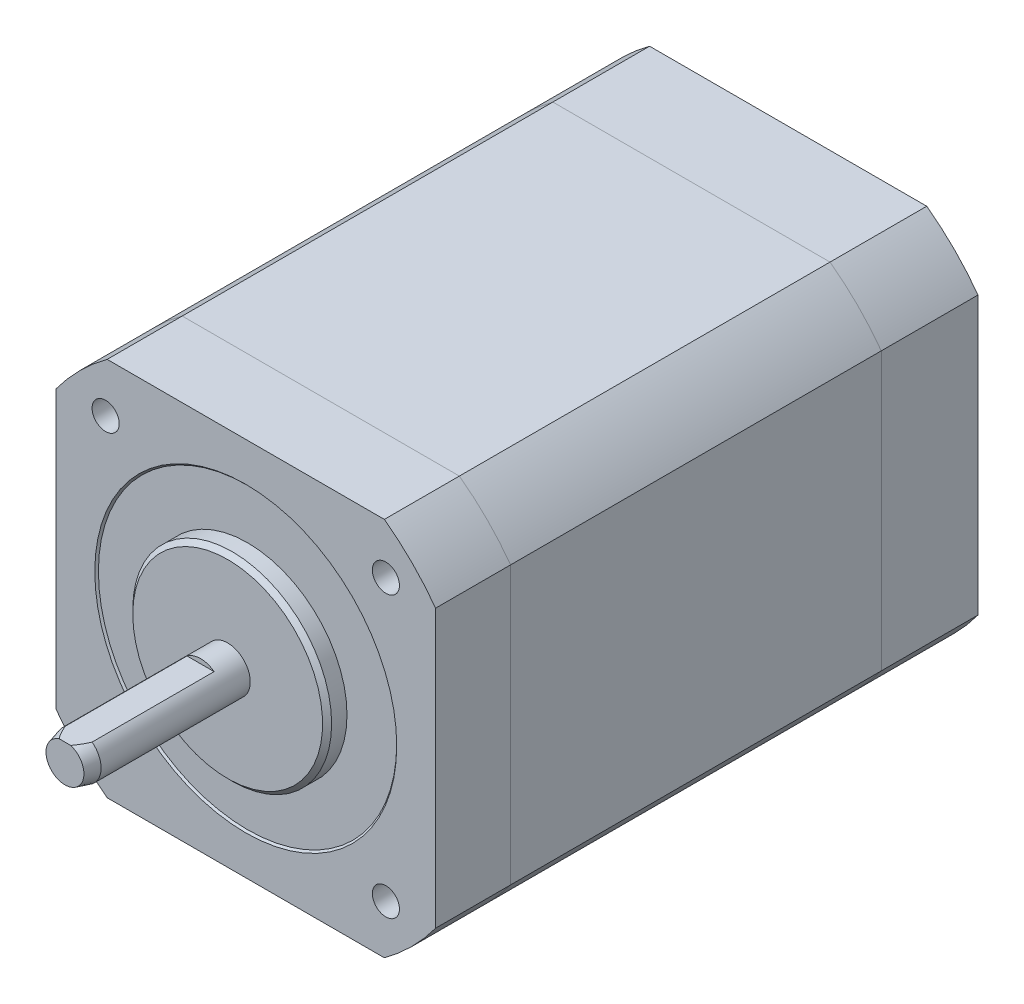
ISO-10303-21;
HEADER;
FILE_DESCRIPTION(('STEP AP214'),'2;1');
FILE_NAME('part.step','',(''),(''),'','','');
FILE_SCHEMA(('AUTOMOTIVE_DESIGN { 1 0 10303 214 1 1 1 1 }'));
ENDSEC;
DATA;
#1=APPLICATION_CONTEXT('core data for automotive mechanical design processes');
#2=APPLICATION_PROTOCOL_DEFINITION('international standard','automotive_design',2000,#1);
#3=PRODUCT_CONTEXT('',#1,'mechanical');
#4=PRODUCT('Part','Part','',(#3));
#5=PRODUCT_RELATED_PRODUCT_CATEGORY('part','',(#4));
#6=PRODUCT_DEFINITION_FORMATION('','',#4);
#7=PRODUCT_DEFINITION_CONTEXT('part definition',#1,'design');
#8=PRODUCT_DEFINITION('design','',#6,#7);
#9=PRODUCT_DEFINITION_SHAPE('','',#8);
#10=(LENGTH_UNIT() NAMED_UNIT(*) SI_UNIT(.MILLI.,.METRE.));
#11=(NAMED_UNIT(*) PLANE_ANGLE_UNIT() SI_UNIT($,.RADIAN.));
#12=(NAMED_UNIT(*) SI_UNIT($,.STERADIAN.) SOLID_ANGLE_UNIT());
#13=UNCERTAINTY_MEASURE_WITH_UNIT(LENGTH_MEASURE(1.E-05),#10,'distance_accuracy_value','');
#14=(GEOMETRIC_REPRESENTATION_CONTEXT(3) GLOBAL_UNCERTAINTY_ASSIGNED_CONTEXT((#13)) GLOBAL_UNIT_ASSIGNED_CONTEXT((#10,
#11,#12)) REPRESENTATION_CONTEXT('',''));
#15=CARTESIAN_POINT('',(0.,0.,0.));
#16=DIRECTION('',(0.,0.,1.));
#17=DIRECTION('',(1.,0.,0.));
#18=AXIS2_PLACEMENT_3D('',#15,#16,#17);
#19=CARTESIAN_POINT('',(-8.39999999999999,-25.6,-51.8));
#20=DIRECTION('',(1.,0.,0.));
#21=DIRECTION('',(0.,0.,-1.));
#22=AXIS2_PLACEMENT_3D('',#19,#20,#21);
#23=PLANE('',#22);
#24=DIRECTION('',(0.,0.,-1.));
#25=VECTOR('',#24,1.);
#26=CARTESIAN_POINT('',(-8.39999999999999,-21.,-51.8));
#27=LINE('',#26,#25);
#28=CARTESIAN_POINT('',(-8.39999999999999,-21.,-51.8));
#29=VERTEX_POINT('',#28);
#30=CARTESIAN_POINT('',(-8.39999999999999,-21.,-62.));
#31=VERTEX_POINT('',#30);
#32=EDGE_CURVE('E123',#29,#31,#27,.T.);
#33=ORIENTED_EDGE('',*,*,#32,.T.);
#34=DIRECTION('',(0.,1.,0.));
#35=VECTOR('',#34,1.);
#36=CARTESIAN_POINT('',(-8.39999999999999,-25.6,-62.));
#37=LINE('',#36,#35);
#38=CARTESIAN_POINT('',(-8.39999999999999,-25.6,-62.));
#39=VERTEX_POINT('',#38);
#40=EDGE_CURVE('E13',#39,#31,#37,.T.);
#41=ORIENTED_EDGE('',*,*,#40,.F.);
#42=DIRECTION('',(0.,0.,-1.));
#43=VECTOR('',#42,1.);
#44=CARTESIAN_POINT('',(-8.39999999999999,-25.6,-51.8));
#45=LINE('',#44,#43);
#46=CARTESIAN_POINT('',(-8.39999999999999,-25.6,-51.8));
#47=VERTEX_POINT('',#46);
#48=EDGE_CURVE('E105',#47,#39,#45,.T.);
#49=ORIENTED_EDGE('',*,*,#48,.F.);
#50=DIRECTION('',(0.,1.,0.));
#51=VECTOR('',#50,1.);
#52=CARTESIAN_POINT('',(-8.39999999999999,-25.6,-51.8));
#53=LINE('',#52,#51);
#54=EDGE_CURVE('E119',#47,#29,#53,.T.);
#55=ORIENTED_EDGE('',*,*,#54,.T.);
#56=EDGE_LOOP('',(#33,#41,#49,#55));
#57=FACE_BOUND('',#56,.T.);
#58=ADVANCED_FACE('F53',(#57),#23,.F.);
#59=CARTESIAN_POINT('',(-8.39999999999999,-25.6,-62.));
#60=DIRECTION('',(0.,0.,1.));
#61=DIRECTION('',(1.,0.,0.));
#62=AXIS2_PLACEMENT_3D('',#59,#60,#61);
#63=PLANE('',#62);
#64=DIRECTION('',(1.,0.,0.));
#65=VECTOR('',#64,1.);
#66=CARTESIAN_POINT('',(-8.39999999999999,-21.,-62.));
#67=LINE('',#66,#65);
#68=CARTESIAN_POINT('',(8.40000000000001,-21.,-62.));
#69=VERTEX_POINT('',#68);
#70=EDGE_CURVE('E110',#31,#69,#67,.T.);
#71=ORIENTED_EDGE('',*,*,#70,.T.);
#72=DIRECTION('',(0.,1.,0.));
#73=VECTOR('',#72,1.);
#74=CARTESIAN_POINT('',(8.40000000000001,-25.6,-62.));
#75=LINE('',#74,#73);
#76=CARTESIAN_POINT('',(8.40000000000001,-25.6,-62.));
#77=VERTEX_POINT('',#76);
#78=EDGE_CURVE('E62',#77,#69,#75,.T.);
#79=ORIENTED_EDGE('',*,*,#78,.F.);
#80=DIRECTION('',(1.,0.,0.));
#81=VECTOR('',#80,1.);
#82=CARTESIAN_POINT('',(-8.39999999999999,-25.6,-62.));
#83=LINE('',#82,#81);
#84=EDGE_CURVE('E100',#39,#77,#83,.T.);
#85=ORIENTED_EDGE('',*,*,#84,.F.);
#86=ORIENTED_EDGE('',*,*,#40,.T.);
#87=EDGE_LOOP('',(#71,#79,#85,#86));
#88=FACE_BOUND('',#87,.T.);
#89=ADVANCED_FACE('F109',(#88),#63,.F.);
#90=CARTESIAN_POINT('',(8.40000000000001,-25.6,-51.8));
#91=DIRECTION('',(-1.,0.,0.));
#92=DIRECTION('',(0.,-1.,0.));
#93=AXIS2_PLACEMENT_3D('',#90,#91,#92);
#94=PLANE('',#93);
#95=DIRECTION('',(0.,0.,1.));
#96=VECTOR('',#95,1.);
#97=CARTESIAN_POINT('',(8.40000000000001,-21.,-51.8));
#98=LINE('',#97,#96);
#99=CARTESIAN_POINT('',(8.40000000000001,-21.,-51.8));
#100=VERTEX_POINT('',#99);
#101=EDGE_CURVE('E87',#69,#100,#98,.T.);
#102=ORIENTED_EDGE('',*,*,#101,.T.);
#103=DIRECTION('',(0.,1.,0.));
#104=VECTOR('',#103,1.);
#105=CARTESIAN_POINT('',(8.40000000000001,-25.6,-51.8));
#106=LINE('',#105,#104);
#107=CARTESIAN_POINT('',(8.40000000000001,-25.6,-51.8));
#108=VERTEX_POINT('',#107);
#109=EDGE_CURVE('E112',#108,#100,#106,.T.);
#110=ORIENTED_EDGE('',*,*,#109,.F.);
#111=DIRECTION('',(0.,0.,1.));
#112=VECTOR('',#111,1.);
#113=CARTESIAN_POINT('',(8.40000000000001,-25.6,-51.8));
#114=LINE('',#113,#112);
#115=EDGE_CURVE('E103',#77,#108,#114,.T.);
#116=ORIENTED_EDGE('',*,*,#115,.F.);
#117=ORIENTED_EDGE('',*,*,#78,.T.);
#118=EDGE_LOOP('',(#102,#110,#116,#117));
#119=FACE_BOUND('',#118,.T.);
#120=ADVANCED_FACE('F113',(#119),#94,.F.);
#121=CARTESIAN_POINT('',(-8.39999999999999,-25.6,-51.8));
#122=DIRECTION('',(0.,0.,-1.));
#123=DIRECTION('',(-1.,0.,0.));
#124=AXIS2_PLACEMENT_3D('',#121,#122,#123);
#125=PLANE('',#124);
#126=DIRECTION('',(-1.,0.,0.));
#127=VECTOR('',#126,1.);
#128=CARTESIAN_POINT('',(-8.39999999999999,-21.,-51.8));
#129=LINE('',#128,#127);
#130=EDGE_CURVE('E93',#100,#29,#129,.T.);
#131=ORIENTED_EDGE('',*,*,#130,.T.);
#132=ORIENTED_EDGE('',*,*,#54,.F.);
#133=DIRECTION('',(-1.,0.,0.));
#134=VECTOR('',#133,1.);
#135=CARTESIAN_POINT('',(-8.39999999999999,-25.6,-51.8));
#136=LINE('',#135,#134);
#137=EDGE_CURVE('E70',#108,#47,#136,.T.);
#138=ORIENTED_EDGE('',*,*,#137,.F.);
#139=ORIENTED_EDGE('',*,*,#109,.T.);
#140=EDGE_LOOP('',(#131,#132,#138,#139));
#141=FACE_BOUND('',#140,.T.);
#142=ADVANCED_FACE('F135',(#141),#125,.F.);
#143=CARTESIAN_POINT('',(0.,-25.6,0.));
#144=DIRECTION('',(0.,-1.,0.));
#145=DIRECTION('',(0.,0.,-1.));
#146=AXIS2_PLACEMENT_3D('',#143,#144,#145);
#147=PLANE('',#146);
#148=ORIENTED_EDGE('',*,*,#48,.T.);
#149=ORIENTED_EDGE('',*,*,#84,.T.);
#150=ORIENTED_EDGE('',*,*,#115,.T.);
#151=ORIENTED_EDGE('',*,*,#137,.T.);
#152=EDGE_LOOP('',(#148,#149,#150,#151));
#153=FACE_BOUND('',#152,.T.);
#154=ADVANCED_FACE('F101',(#153),#147,.T.);
#155=CARTESIAN_POINT('',(0.,-21.,0.));
#156=DIRECTION('',(0.,-1.,0.));
#157=DIRECTION('',(0.,0.,-1.));
#158=AXIS2_PLACEMENT_3D('',#155,#156,#157);
#159=PLANE('',#158);
#160=ORIENTED_EDGE('',*,*,#32,.F.);
#161=ORIENTED_EDGE('',*,*,#130,.F.);
#162=ORIENTED_EDGE('',*,*,#101,.F.);
#163=ORIENTED_EDGE('',*,*,#70,.F.);
#164=EDGE_LOOP('',(#160,#161,#162,#163));
#165=FACE_BOUND('',#164,.T.);
#166=ADVANCED_FACE('F138',(#165),#159,.F.);
#167=CLOSED_SHELL('',(#58,#89,#120,#142,#154,#166));
#168=MANIFOLD_SOLID_BREP('B2',#167);
#169=CARTESIAN_POINT('',(0.,0.,-62.));
#170=DIRECTION('',(0.,0.,1.));
#171=DIRECTION('',(1.,0.,0.));
#172=AXIS2_PLACEMENT_3D('',#169,#170,#171);
#173=CYLINDRICAL_SURFACE('',#172,26.);
#174=CARTESIAN_POINT('',(0.,0.,-51.3));
#175=DIRECTION('',(0.,0.,-1.));
#176=DIRECTION('',(-1.,0.,0.));
#177=AXIS2_PLACEMENT_3D('',#174,#175,#176);
#178=CIRCLE('',#177,26.);
#179=CARTESIAN_POINT('',(21.,-15.3297097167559,-51.3));
#180=VERTEX_POINT('',#179);
#181=CARTESIAN_POINT('',(15.3297097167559,-21.,-51.3));
#182=VERTEX_POINT('',#181);
#183=EDGE_CURVE('E308',#180,#182,#178,.T.);
#184=ORIENTED_EDGE('',*,*,#183,.T.);
#185=DIRECTION('',(0.,0.,1.));
#186=VECTOR('',#185,1.);
#187=CARTESIAN_POINT('',(15.3297097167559,-21.,-62.));
#188=LINE('',#187,#186);
#189=CARTESIAN_POINT('',(15.3297097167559,-21.,-62.));
#190=VERTEX_POINT('',#189);
#191=EDGE_CURVE('E51',#190,#182,#188,.T.);
#192=ORIENTED_EDGE('',*,*,#191,.F.);
#193=CARTESIAN_POINT('',(0.,0.,-62.));
#194=DIRECTION('',(0.,0.,-1.));
#195=DIRECTION('',(-1.,0.,0.));
#196=AXIS2_PLACEMENT_3D('',#193,#194,#195);
#197=CIRCLE('',#196,26.);
#198=CARTESIAN_POINT('',(21.,-15.3297097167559,-62.));
#199=VERTEX_POINT('',#198);
#200=EDGE_CURVE('E329',#199,#190,#197,.T.);
#201=ORIENTED_EDGE('',*,*,#200,.F.);
#202=DIRECTION('',(0.,0.,1.));
#203=VECTOR('',#202,1.);
#204=CARTESIAN_POINT('',(21.,-15.3297097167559,-62.));
#205=LINE('',#204,#203);
#206=EDGE_CURVE('E304',#199,#180,#205,.T.);
#207=ORIENTED_EDGE('',*,*,#206,.T.);
#208=EDGE_LOOP('',(#184,#192,#201,#207));
#209=FACE_BOUND('',#208,.T.);
#210=ADVANCED_FACE('F205',(#209),#173,.T.);
#211=CARTESIAN_POINT('',(15.3297097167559,-21.,-62.));
#212=DIRECTION('',(0.,1.,0.));
#213=DIRECTION('',(-1.,0.,0.));
#214=AXIS2_PLACEMENT_3D('',#211,#212,#213);
#215=PLANE('',#214);
#216=DIRECTION('',(-1.,0.,0.));
#217=VECTOR('',#216,1.);
#218=CARTESIAN_POINT('',(15.3297097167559,-21.,-51.3));
#219=LINE('',#218,#217);
#220=CARTESIAN_POINT('',(-15.3297097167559,-21.,-51.3));
#221=VERTEX_POINT('',#220);
#222=EDGE_CURVE('E312',#182,#221,#219,.T.);
#223=ORIENTED_EDGE('',*,*,#222,.T.);
#224=DIRECTION('',(0.,0.,1.));
#225=VECTOR('',#224,1.);
#226=CARTESIAN_POINT('',(-15.3297097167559,-21.,-62.));
#227=LINE('',#226,#225);
#228=CARTESIAN_POINT('',(-15.3297097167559,-21.,-62.));
#229=VERTEX_POINT('',#228);
#230=EDGE_CURVE('E214',#229,#221,#227,.T.);
#231=ORIENTED_EDGE('',*,*,#230,.F.);
#232=DIRECTION('',(-1.,0.,0.));
#233=VECTOR('',#232,1.);
#234=CARTESIAN_POINT('',(15.3297097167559,-21.,-62.));
#235=LINE('',#234,#233);
#236=EDGE_CURVE('E265',#190,#229,#235,.T.);
#237=ORIENTED_EDGE('',*,*,#236,.F.);
#238=ORIENTED_EDGE('',*,*,#191,.T.);
#239=EDGE_LOOP('',(#223,#231,#237,#238));
#240=FACE_BOUND('',#239,.T.);
#241=ADVANCED_FACE('F374',(#240),#215,.F.);
#242=CARTESIAN_POINT('',(0.,0.,-62.));
#243=DIRECTION('',(0.,0.,1.));
#244=DIRECTION('',(1.,0.,0.));
#245=AXIS2_PLACEMENT_3D('',#242,#243,#244);
#246=CYLINDRICAL_SURFACE('',#245,26.);
#247=CARTESIAN_POINT('',(0.,0.,-51.3));
#248=DIRECTION('',(0.,0.,-1.));
#249=DIRECTION('',(-1.,0.,0.));
#250=AXIS2_PLACEMENT_3D('',#247,#248,#249);
#251=CIRCLE('',#250,26.);
#252=CARTESIAN_POINT('',(-21.,-15.3297097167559,-51.3));
#253=VERTEX_POINT('',#252);
#254=EDGE_CURVE('E315',#221,#253,#251,.T.);
#255=ORIENTED_EDGE('',*,*,#254,.T.);
#256=DIRECTION('',(0.,0.,1.));
#257=VECTOR('',#256,1.);
#258=CARTESIAN_POINT('',(-21.,-15.3297097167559,-62.));
#259=LINE('',#258,#257);
#260=CARTESIAN_POINT('',(-21.,-15.3297097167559,-62.));
#261=VERTEX_POINT('',#260);
#262=EDGE_CURVE('E340',#261,#253,#259,.T.);
#263=ORIENTED_EDGE('',*,*,#262,.F.);
#264=CARTESIAN_POINT('',(0.,0.,-62.));
#265=DIRECTION('',(0.,0.,-1.));
#266=DIRECTION('',(-1.,0.,0.));
#267=AXIS2_PLACEMENT_3D('',#264,#265,#266);
#268=CIRCLE('',#267,26.);
#269=EDGE_CURVE('E350',#229,#261,#268,.T.);
#270=ORIENTED_EDGE('',*,*,#269,.F.);
#271=ORIENTED_EDGE('',*,*,#230,.T.);
#272=EDGE_LOOP('',(#255,#263,#270,#271));
#273=FACE_BOUND('',#272,.T.);
#274=ADVANCED_FACE('F348',(#273),#246,.T.);
#275=CARTESIAN_POINT('',(-21.,-15.3297097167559,-62.));
#276=DIRECTION('',(1.,0.,0.));
#277=DIRECTION('',(0.,1.,0.));
#278=AXIS2_PLACEMENT_3D('',#275,#276,#277);
#279=PLANE('',#278);
#280=DIRECTION('',(0.,1.,0.));
#281=VECTOR('',#280,1.);
#282=CARTESIAN_POINT('',(-21.,-15.3297097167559,-51.3));
#283=LINE('',#282,#281);
#284=CARTESIAN_POINT('',(-21.,15.3297097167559,-51.3));
#285=VERTEX_POINT('',#284);
#286=EDGE_CURVE('E318',#253,#285,#283,.T.);
#287=ORIENTED_EDGE('',*,*,#286,.T.);
#288=DIRECTION('',(0.,0.,1.));
#289=VECTOR('',#288,1.);
#290=CARTESIAN_POINT('',(-21.,15.3297097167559,-62.));
#291=LINE('',#290,#289);
#292=CARTESIAN_POINT('',(-21.,15.3297097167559,-62.));
#293=VERTEX_POINT('',#292);
#294=EDGE_CURVE('E336',#293,#285,#291,.T.);
#295=ORIENTED_EDGE('',*,*,#294,.F.);
#296=DIRECTION('',(0.,1.,0.));
#297=VECTOR('',#296,1.);
#298=CARTESIAN_POINT('',(-21.,-15.3297097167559,-62.));
#299=LINE('',#298,#297);
#300=EDGE_CURVE('E362',#261,#293,#299,.T.);
#301=ORIENTED_EDGE('',*,*,#300,.F.);
#302=ORIENTED_EDGE('',*,*,#262,.T.);
#303=EDGE_LOOP('',(#287,#295,#301,#302));
#304=FACE_BOUND('',#303,.T.);
#305=ADVANCED_FACE('F358',(#304),#279,.F.);
#306=CARTESIAN_POINT('',(0.,0.,-62.));
#307=DIRECTION('',(0.,0.,1.));
#308=DIRECTION('',(1.,0.,0.));
#309=AXIS2_PLACEMENT_3D('',#306,#307,#308);
#310=CYLINDRICAL_SURFACE('',#309,26.);
#311=CARTESIAN_POINT('',(0.,0.,-51.3));
#312=DIRECTION('',(0.,0.,-1.));
#313=DIRECTION('',(-1.,0.,0.));
#314=AXIS2_PLACEMENT_3D('',#311,#312,#313);
#315=CIRCLE('',#314,26.);
#316=CARTESIAN_POINT('',(-15.3297097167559,21.,-51.3));
#317=VERTEX_POINT('',#316);
#318=EDGE_CURVE('E321',#285,#317,#315,.T.);
#319=ORIENTED_EDGE('',*,*,#318,.T.);
#320=DIRECTION('',(0.,0.,1.));
#321=VECTOR('',#320,1.);
#322=CARTESIAN_POINT('',(-15.3297097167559,21.,-62.));
#323=LINE('',#322,#321);
#324=CARTESIAN_POINT('',(-15.3297097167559,21.,-62.));
#325=VERTEX_POINT('',#324);
#326=EDGE_CURVE('E295',#325,#317,#323,.T.);
#327=ORIENTED_EDGE('',*,*,#326,.F.);
#328=CARTESIAN_POINT('',(0.,0.,-62.));
#329=DIRECTION('',(0.,0.,-1.));
#330=DIRECTION('',(-1.,0.,0.));
#331=AXIS2_PLACEMENT_3D('',#328,#329,#330);
#332=CIRCLE('',#331,26.);
#333=EDGE_CURVE('E284',#293,#325,#332,.T.);
#334=ORIENTED_EDGE('',*,*,#333,.F.);
#335=ORIENTED_EDGE('',*,*,#294,.T.);
#336=EDGE_LOOP('',(#319,#327,#334,#335));
#337=FACE_BOUND('',#336,.T.);
#338=ADVANCED_FACE('F361',(#337),#310,.T.);
#339=CARTESIAN_POINT('',(-15.3297097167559,21.,-62.));
#340=DIRECTION('',(0.,-1.,0.));
#341=DIRECTION('',(0.,0.,-1.));
#342=AXIS2_PLACEMENT_3D('',#339,#340,#341);
#343=PLANE('',#342);
#344=DIRECTION('',(1.,0.,0.));
#345=VECTOR('',#344,1.);
#346=CARTESIAN_POINT('',(-15.3297097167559,21.,-51.3));
#347=LINE('',#346,#345);
#348=CARTESIAN_POINT('',(15.3297097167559,21.,-51.3));
#349=VERTEX_POINT('',#348);
#350=EDGE_CURVE('E293',#317,#349,#347,.T.);
#351=ORIENTED_EDGE('',*,*,#350,.T.);
#352=DIRECTION('',(0.,0.,1.));
#353=VECTOR('',#352,1.);
#354=CARTESIAN_POINT('',(15.3297097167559,21.,-62.));
#355=LINE('',#354,#353);
#356=CARTESIAN_POINT('',(15.3297097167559,21.,-62.));
#357=VERTEX_POINT('',#356);
#358=EDGE_CURVE('E290',#357,#349,#355,.T.);
#359=ORIENTED_EDGE('',*,*,#358,.F.);
#360=DIRECTION('',(1.,0.,0.));
#361=VECTOR('',#360,1.);
#362=CARTESIAN_POINT('',(-15.3297097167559,21.,-62.));
#363=LINE('',#362,#361);
#364=EDGE_CURVE('E278',#325,#357,#363,.T.);
#365=ORIENTED_EDGE('',*,*,#364,.F.);
#366=ORIENTED_EDGE('',*,*,#326,.T.);
#367=EDGE_LOOP('',(#351,#359,#365,#366));
#368=FACE_BOUND('',#367,.T.);
#369=ADVANCED_FACE('F291',(#368),#343,.F.);
#370=CARTESIAN_POINT('',(0.,0.,-62.));
#371=DIRECTION('',(0.,0.,1.));
#372=DIRECTION('',(1.,0.,0.));
#373=AXIS2_PLACEMENT_3D('',#370,#371,#372);
#374=CYLINDRICAL_SURFACE('',#373,26.);
#375=CARTESIAN_POINT('',(0.,0.,-51.3));
#376=DIRECTION('',(0.,0.,-1.));
#377=DIRECTION('',(-1.,0.,0.));
#378=AXIS2_PLACEMENT_3D('',#375,#376,#377);
#379=CIRCLE('',#378,26.);
#380=CARTESIAN_POINT('',(21.,15.3297097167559,-51.3));
#381=VERTEX_POINT('',#380);
#382=EDGE_CURVE('E251',#349,#381,#379,.T.);
#383=ORIENTED_EDGE('',*,*,#382,.T.);
#384=DIRECTION('',(0.,0.,1.));
#385=VECTOR('',#384,1.);
#386=CARTESIAN_POINT('',(21.,15.3297097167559,-62.));
#387=LINE('',#386,#385);
#388=CARTESIAN_POINT('',(21.,15.3297097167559,-62.));
#389=VERTEX_POINT('',#388);
#390=EDGE_CURVE('E296',#389,#381,#387,.T.);
#391=ORIENTED_EDGE('',*,*,#390,.F.);
#392=CARTESIAN_POINT('',(0.,0.,-62.));
#393=DIRECTION('',(0.,0.,-1.));
#394=DIRECTION('',(-1.,0.,0.));
#395=AXIS2_PLACEMENT_3D('',#392,#393,#394);
#396=CIRCLE('',#395,26.);
#397=EDGE_CURVE('E282',#357,#389,#396,.T.);
#398=ORIENTED_EDGE('',*,*,#397,.F.);
#399=ORIENTED_EDGE('',*,*,#358,.T.);
#400=EDGE_LOOP('',(#383,#391,#398,#399));
#401=FACE_BOUND('',#400,.T.);
#402=ADVANCED_FACE('F298',(#401),#374,.T.);
#403=CARTESIAN_POINT('',(21.,15.3297097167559,-62.));
#404=DIRECTION('',(-1.,0.,0.));
#405=DIRECTION('',(0.,-1.,0.));
#406=AXIS2_PLACEMENT_3D('',#403,#404,#405);
#407=PLANE('',#406);
#408=DIRECTION('',(0.,-1.,0.));
#409=VECTOR('',#408,1.);
#410=CARTESIAN_POINT('',(21.,15.3297097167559,-51.3));
#411=LINE('',#410,#409);
#412=EDGE_CURVE('E257',#381,#180,#411,.T.);
#413=ORIENTED_EDGE('',*,*,#412,.T.);
#414=ORIENTED_EDGE('',*,*,#206,.F.);
#415=DIRECTION('',(0.,-1.,0.));
#416=VECTOR('',#415,1.);
#417=CARTESIAN_POINT('',(21.,15.3297097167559,-62.));
#418=LINE('',#417,#416);
#419=EDGE_CURVE('E222',#389,#199,#418,.T.);
#420=ORIENTED_EDGE('',*,*,#419,.F.);
#421=ORIENTED_EDGE('',*,*,#390,.T.);
#422=EDGE_LOOP('',(#413,#414,#420,#421));
#423=FACE_BOUND('',#422,.T.);
#424=ADVANCED_FACE('F390',(#423),#407,.F.);
#425=CARTESIAN_POINT('',(0.,0.,-62.));
#426=DIRECTION('',(0.,0.,-1.));
#427=DIRECTION('',(-1.,0.,0.));
#428=AXIS2_PLACEMENT_3D('',#425,#426,#427);
#429=PLANE('',#428);
#430=ORIENTED_EDGE('',*,*,#200,.T.);
#431=ORIENTED_EDGE('',*,*,#236,.T.);
#432=ORIENTED_EDGE('',*,*,#269,.T.);
#433=ORIENTED_EDGE('',*,*,#300,.T.);
#434=ORIENTED_EDGE('',*,*,#333,.T.);
#435=ORIENTED_EDGE('',*,*,#364,.T.);
#436=ORIENTED_EDGE('',*,*,#397,.T.);
#437=ORIENTED_EDGE('',*,*,#419,.T.);
#438=EDGE_LOOP('',(#430,#431,#432,#433,#434,#435,#436,#437));
#439=FACE_BOUND('',#438,.T.);
#440=ADVANCED_FACE('F280',(#439),#429,.T.);
#441=CARTESIAN_POINT('',(0.,0.,-51.3));
#442=DIRECTION('',(0.,0.,-1.));
#443=DIRECTION('',(-1.,0.,0.));
#444=AXIS2_PLACEMENT_3D('',#441,#442,#443);
#445=PLANE('',#444);
#446=ORIENTED_EDGE('',*,*,#183,.F.);
#447=ORIENTED_EDGE('',*,*,#412,.F.);
#448=ORIENTED_EDGE('',*,*,#382,.F.);
#449=ORIENTED_EDGE('',*,*,#350,.F.);
#450=ORIENTED_EDGE('',*,*,#318,.F.);
#451=ORIENTED_EDGE('',*,*,#286,.F.);
#452=ORIENTED_EDGE('',*,*,#254,.F.);
#453=ORIENTED_EDGE('',*,*,#222,.F.);
#454=EDGE_LOOP('',(#446,#447,#448,#449,#450,#451,#452,#453));
#455=FACE_BOUND('',#454,.T.);
#456=ADVANCED_FACE('F354',(#455),#445,.F.);
#457=CLOSED_SHELL('',(#210,#241,#274,#305,#338,#369,#402,#424,#440,#456));
#458=MANIFOLD_SOLID_BREP('B7',#457);
#459=CARTESIAN_POINT('',(0.,0.,-51.3));
#460=DIRECTION('',(0.,0.,1.));
#461=DIRECTION('',(1.,0.,0.));
#462=AXIS2_PLACEMENT_3D('',#459,#460,#461);
#463=CYLINDRICAL_SURFACE('',#462,26.);
#464=CARTESIAN_POINT('',(0.,0.,-10.3));
#465=DIRECTION('',(0.,0.,-1.));
#466=DIRECTION('',(-1.,0.,0.));
#467=AXIS2_PLACEMENT_3D('',#464,#465,#466);
#468=CIRCLE('',#467,26.);
#469=CARTESIAN_POINT('',(21.,-15.3297097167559,-10.3));
#470=VERTEX_POINT('',#469);
#471=CARTESIAN_POINT('',(15.3297097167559,-21.,-10.3));
#472=VERTEX_POINT('',#471);
#473=EDGE_CURVE('E579',#470,#472,#468,.T.);
#474=ORIENTED_EDGE('',*,*,#473,.T.);
#475=DIRECTION('',(0.,0.,1.));
#476=VECTOR('',#475,1.);
#477=CARTESIAN_POINT('',(15.3297097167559,-21.,-51.3));
#478=LINE('',#477,#476);
#479=CARTESIAN_POINT('',(15.3297097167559,-21.,-51.3));
#480=VERTEX_POINT('',#479);
#481=EDGE_CURVE('E203',#480,#472,#478,.T.);
#482=ORIENTED_EDGE('',*,*,#481,.F.);
#483=CARTESIAN_POINT('',(0.,0.,-51.3));
#484=DIRECTION('',(0.,0.,-1.));
#485=DIRECTION('',(-1.,0.,0.));
#486=AXIS2_PLACEMENT_3D('',#483,#484,#485);
#487=CIRCLE('',#486,26.);
#488=CARTESIAN_POINT('',(21.,-15.3297097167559,-51.3));
#489=VERTEX_POINT('',#488);
#490=EDGE_CURVE('E599',#489,#480,#487,.T.);
#491=ORIENTED_EDGE('',*,*,#490,.F.);
#492=DIRECTION('',(0.,0.,1.));
#493=VECTOR('',#492,1.);
#494=CARTESIAN_POINT('',(21.,-15.3297097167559,-51.3));
#495=LINE('',#494,#493);
#496=EDGE_CURVE('E575',#489,#470,#495,.T.);
#497=ORIENTED_EDGE('',*,*,#496,.T.);
#498=EDGE_LOOP('',(#474,#482,#491,#497));
#499=FACE_BOUND('',#498,.T.);
#500=ADVANCED_FACE('F476',(#499),#463,.T.);
#501=CARTESIAN_POINT('',(15.3297097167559,-21.,-51.3));
#502=DIRECTION('',(0.,1.,0.));
#503=DIRECTION('',(0.,0.,1.));
#504=AXIS2_PLACEMENT_3D('',#501,#502,#503);
#505=PLANE('',#504);
#506=DIRECTION('',(-1.,0.,0.));
#507=VECTOR('',#506,1.);
#508=CARTESIAN_POINT('',(15.3297097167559,-21.,-10.3));
#509=LINE('',#508,#507);
#510=CARTESIAN_POINT('',(-15.3297097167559,-21.,-10.3));
#511=VERTEX_POINT('',#510);
#512=EDGE_CURVE('E583',#472,#511,#509,.T.);
#513=ORIENTED_EDGE('',*,*,#512,.T.);
#514=DIRECTION('',(0.,0.,1.));
#515=VECTOR('',#514,1.);
#516=CARTESIAN_POINT('',(-15.3297097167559,-21.,-51.3));
#517=LINE('',#516,#515);
#518=CARTESIAN_POINT('',(-15.3297097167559,-21.,-51.3));
#519=VERTEX_POINT('',#518);
#520=EDGE_CURVE('E485',#519,#511,#517,.T.);
#521=ORIENTED_EDGE('',*,*,#520,.F.);
#522=DIRECTION('',(-1.,0.,0.));
#523=VECTOR('',#522,1.);
#524=CARTESIAN_POINT('',(15.3297097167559,-21.,-51.3));
#525=LINE('',#524,#523);
#526=EDGE_CURVE('E536',#480,#519,#525,.T.);
#527=ORIENTED_EDGE('',*,*,#526,.F.);
#528=ORIENTED_EDGE('',*,*,#481,.T.);
#529=EDGE_LOOP('',(#513,#521,#527,#528));
#530=FACE_BOUND('',#529,.T.);
#531=ADVANCED_FACE('F645',(#530),#505,.F.);
#532=CARTESIAN_POINT('',(0.,0.,-51.3));
#533=DIRECTION('',(0.,0.,1.));
#534=DIRECTION('',(1.,0.,0.));
#535=AXIS2_PLACEMENT_3D('',#532,#533,#534);
#536=CYLINDRICAL_SURFACE('',#535,26.);
#537=CARTESIAN_POINT('',(0.,0.,-10.3));
#538=DIRECTION('',(0.,0.,-1.));
#539=DIRECTION('',(-1.,0.,0.));
#540=AXIS2_PLACEMENT_3D('',#537,#538,#539);
#541=CIRCLE('',#540,26.);
#542=CARTESIAN_POINT('',(-21.,-15.3297097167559,-10.3));
#543=VERTEX_POINT('',#542);
#544=EDGE_CURVE('E586',#511,#543,#541,.T.);
#545=ORIENTED_EDGE('',*,*,#544,.T.);
#546=DIRECTION('',(0.,0.,1.));
#547=VECTOR('',#546,1.);
#548=CARTESIAN_POINT('',(-21.,-15.3297097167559,-51.3));
#549=LINE('',#548,#547);
#550=CARTESIAN_POINT('',(-21.,-15.3297097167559,-51.3));
#551=VERTEX_POINT('',#550);
#552=EDGE_CURVE('E610',#551,#543,#549,.T.);
#553=ORIENTED_EDGE('',*,*,#552,.F.);
#554=CARTESIAN_POINT('',(0.,0.,-51.3));
#555=DIRECTION('',(0.,0.,-1.));
#556=DIRECTION('',(-1.,0.,0.));
#557=AXIS2_PLACEMENT_3D('',#554,#555,#556);
#558=CIRCLE('',#557,26.);
#559=EDGE_CURVE('E621',#519,#551,#558,.T.);
#560=ORIENTED_EDGE('',*,*,#559,.F.);
#561=ORIENTED_EDGE('',*,*,#520,.T.);
#562=EDGE_LOOP('',(#545,#553,#560,#561));
#563=FACE_BOUND('',#562,.T.);
#564=ADVANCED_FACE('F619',(#563),#536,.T.);
#565=CARTESIAN_POINT('',(-21.,-15.3297097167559,-51.3));
#566=DIRECTION('',(1.,0.,0.));
#567=DIRECTION('',(0.,0.,-1.));
#568=AXIS2_PLACEMENT_3D('',#565,#566,#567);
#569=PLANE('',#568);
#570=DIRECTION('',(0.,1.,0.));
#571=VECTOR('',#570,1.);
#572=CARTESIAN_POINT('',(-21.,-15.3297097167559,-10.3));
#573=LINE('',#572,#571);
#574=CARTESIAN_POINT('',(-21.,15.3297097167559,-10.3));
#575=VERTEX_POINT('',#574);
#576=EDGE_CURVE('E589',#543,#575,#573,.T.);
#577=ORIENTED_EDGE('',*,*,#576,.T.);
#578=DIRECTION('',(0.,0.,1.));
#579=VECTOR('',#578,1.);
#580=CARTESIAN_POINT('',(-21.,15.3297097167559,-51.3));
#581=LINE('',#580,#579);
#582=CARTESIAN_POINT('',(-21.,15.3297097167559,-51.3));
#583=VERTEX_POINT('',#582);
#584=EDGE_CURVE('E606',#583,#575,#581,.T.);
#585=ORIENTED_EDGE('',*,*,#584,.F.);
#586=DIRECTION('',(0.,1.,0.));
#587=VECTOR('',#586,1.);
#588=CARTESIAN_POINT('',(-21.,-15.3297097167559,-51.3));
#589=LINE('',#588,#587);
#590=EDGE_CURVE('E634',#551,#583,#589,.T.);
#591=ORIENTED_EDGE('',*,*,#590,.F.);
#592=ORIENTED_EDGE('',*,*,#552,.T.);
#593=EDGE_LOOP('',(#577,#585,#591,#592));
#594=FACE_BOUND('',#593,.T.);
#595=ADVANCED_FACE('F629',(#594),#569,.F.);
#596=CARTESIAN_POINT('',(0.,0.,-51.3));
#597=DIRECTION('',(0.,0.,1.));
#598=DIRECTION('',(1.,0.,0.));
#599=AXIS2_PLACEMENT_3D('',#596,#597,#598);
#600=CYLINDRICAL_SURFACE('',#599,26.);
#601=CARTESIAN_POINT('',(0.,0.,-10.3));
#602=DIRECTION('',(0.,0.,-1.));
#603=DIRECTION('',(-1.,0.,0.));
#604=AXIS2_PLACEMENT_3D('',#601,#602,#603);
#605=CIRCLE('',#604,26.);
#606=CARTESIAN_POINT('',(-15.3297097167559,21.,-10.3));
#607=VERTEX_POINT('',#606);
#608=EDGE_CURVE('E591',#575,#607,#605,.T.);
#609=ORIENTED_EDGE('',*,*,#608,.T.);
#610=DIRECTION('',(0.,0.,1.));
#611=VECTOR('',#610,1.);
#612=CARTESIAN_POINT('',(-15.3297097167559,21.,-51.3));
#613=LINE('',#612,#611);
#614=CARTESIAN_POINT('',(-15.3297097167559,21.,-51.3));
#615=VERTEX_POINT('',#614);
#616=EDGE_CURVE('E566',#615,#607,#613,.T.);
#617=ORIENTED_EDGE('',*,*,#616,.F.);
#618=CARTESIAN_POINT('',(0.,0.,-51.3));
#619=DIRECTION('',(0.,0.,-1.));
#620=DIRECTION('',(-1.,0.,0.));
#621=AXIS2_PLACEMENT_3D('',#618,#619,#620);
#622=CIRCLE('',#621,26.);
#623=EDGE_CURVE('E555',#583,#615,#622,.T.);
#624=ORIENTED_EDGE('',*,*,#623,.F.);
#625=ORIENTED_EDGE('',*,*,#584,.T.);
#626=EDGE_LOOP('',(#609,#617,#624,#625));
#627=FACE_BOUND('',#626,.T.);
#628=ADVANCED_FACE('F632',(#627),#600,.T.);
#629=CARTESIAN_POINT('',(-15.3297097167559,21.,-51.3));
#630=DIRECTION('',(0.,-1.,0.));
#631=DIRECTION('',(0.,0.,-1.));
#632=AXIS2_PLACEMENT_3D('',#629,#630,#631);
#633=PLANE('',#632);
#634=DIRECTION('',(1.,0.,0.));
#635=VECTOR('',#634,1.);
#636=CARTESIAN_POINT('',(-15.3297097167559,21.,-10.3));
#637=LINE('',#636,#635);
#638=CARTESIAN_POINT('',(15.3297097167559,21.,-10.3));
#639=VERTEX_POINT('',#638);
#640=EDGE_CURVE('E564',#607,#639,#637,.T.);
#641=ORIENTED_EDGE('',*,*,#640,.T.);
#642=DIRECTION('',(0.,0.,1.));
#643=VECTOR('',#642,1.);
#644=CARTESIAN_POINT('',(15.3297097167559,21.,-51.3));
#645=LINE('',#644,#643);
#646=CARTESIAN_POINT('',(15.3297097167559,21.,-51.3));
#647=VERTEX_POINT('',#646);
#648=EDGE_CURVE('E561',#647,#639,#645,.T.);
#649=ORIENTED_EDGE('',*,*,#648,.F.);
#650=DIRECTION('',(1.,0.,0.));
#651=VECTOR('',#650,1.);
#652=CARTESIAN_POINT('',(-15.3297097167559,21.,-51.3));
#653=LINE('',#652,#651);
#654=EDGE_CURVE('E549',#615,#647,#653,.T.);
#655=ORIENTED_EDGE('',*,*,#654,.F.);
#656=ORIENTED_EDGE('',*,*,#616,.T.);
#657=EDGE_LOOP('',(#641,#649,#655,#656));
#658=FACE_BOUND('',#657,.T.);
#659=ADVANCED_FACE('F562',(#658),#633,.F.);
#660=CARTESIAN_POINT('',(0.,0.,-51.3));
#661=DIRECTION('',(0.,0.,1.));
#662=DIRECTION('',(1.,0.,0.));
#663=AXIS2_PLACEMENT_3D('',#660,#661,#662);
#664=CYLINDRICAL_SURFACE('',#663,26.);
#665=CARTESIAN_POINT('',(0.,0.,-10.3));
#666=DIRECTION('',(0.,0.,-1.));
#667=DIRECTION('',(-1.,0.,0.));
#668=AXIS2_PLACEMENT_3D('',#665,#666,#667);
#669=CIRCLE('',#668,26.);
#670=CARTESIAN_POINT('',(21.,15.3297097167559,-10.3));
#671=VERTEX_POINT('',#670);
#672=EDGE_CURVE('E522',#639,#671,#669,.T.);
#673=ORIENTED_EDGE('',*,*,#672,.T.);
#674=DIRECTION('',(0.,0.,1.));
#675=VECTOR('',#674,1.);
#676=CARTESIAN_POINT('',(21.,15.3297097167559,-51.3));
#677=LINE('',#676,#675);
#678=CARTESIAN_POINT('',(21.,15.3297097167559,-51.3));
#679=VERTEX_POINT('',#678);
#680=EDGE_CURVE('E567',#679,#671,#677,.T.);
#681=ORIENTED_EDGE('',*,*,#680,.F.);
#682=CARTESIAN_POINT('',(0.,0.,-51.3));
#683=DIRECTION('',(0.,0.,-1.));
#684=DIRECTION('',(-1.,0.,0.));
#685=AXIS2_PLACEMENT_3D('',#682,#683,#684);
#686=CIRCLE('',#685,26.);
#687=EDGE_CURVE('E553',#647,#679,#686,.T.);
#688=ORIENTED_EDGE('',*,*,#687,.F.);
#689=ORIENTED_EDGE('',*,*,#648,.T.);
#690=EDGE_LOOP('',(#673,#681,#688,#689));
#691=FACE_BOUND('',#690,.T.);
#692=ADVANCED_FACE('F569',(#691),#664,.T.);
#693=CARTESIAN_POINT('',(21.,15.3297097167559,-51.3));
#694=DIRECTION('',(-1.,0.,0.));
#695=DIRECTION('',(0.,0.,1.));
#696=AXIS2_PLACEMENT_3D('',#693,#694,#695);
#697=PLANE('',#696);
#698=DIRECTION('',(0.,-1.,0.));
#699=VECTOR('',#698,1.);
#700=CARTESIAN_POINT('',(21.,15.3297097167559,-10.3));
#701=LINE('',#700,#699);
#702=EDGE_CURVE('E528',#671,#470,#701,.T.);
#703=ORIENTED_EDGE('',*,*,#702,.T.);
#704=ORIENTED_EDGE('',*,*,#496,.F.);
#705=DIRECTION('',(0.,-1.,0.));
#706=VECTOR('',#705,1.);
#707=CARTESIAN_POINT('',(21.,15.3297097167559,-51.3));
#708=LINE('',#707,#706);
#709=EDGE_CURVE('E493',#679,#489,#708,.T.);
#710=ORIENTED_EDGE('',*,*,#709,.F.);
#711=ORIENTED_EDGE('',*,*,#680,.T.);
#712=EDGE_LOOP('',(#703,#704,#710,#711));
#713=FACE_BOUND('',#712,.T.);
#714=ADVANCED_FACE('F661',(#713),#697,.F.);
#715=CARTESIAN_POINT('',(0.,0.,-51.3));
#716=DIRECTION('',(0.,0.,-1.));
#717=DIRECTION('',(-1.,0.,0.));
#718=AXIS2_PLACEMENT_3D('',#715,#716,#717);
#719=PLANE('',#718);
#720=ORIENTED_EDGE('',*,*,#490,.T.);
#721=ORIENTED_EDGE('',*,*,#526,.T.);
#722=ORIENTED_EDGE('',*,*,#559,.T.);
#723=ORIENTED_EDGE('',*,*,#590,.T.);
#724=ORIENTED_EDGE('',*,*,#623,.T.);
#725=ORIENTED_EDGE('',*,*,#654,.T.);
#726=ORIENTED_EDGE('',*,*,#687,.T.);
#727=ORIENTED_EDGE('',*,*,#709,.T.);
#728=EDGE_LOOP('',(#720,#721,#722,#723,#724,#725,#726,#727));
#729=FACE_BOUND('',#728,.T.);
#730=ADVANCED_FACE('F551',(#729),#719,.T.);
#731=CARTESIAN_POINT('',(0.,0.,-10.3));
#732=DIRECTION('',(0.,0.,-1.));
#733=DIRECTION('',(-1.,0.,0.));
#734=AXIS2_PLACEMENT_3D('',#731,#732,#733);
#735=PLANE('',#734);
#736=ORIENTED_EDGE('',*,*,#473,.F.);
#737=ORIENTED_EDGE('',*,*,#702,.F.);
#738=ORIENTED_EDGE('',*,*,#672,.F.);
#739=ORIENTED_EDGE('',*,*,#640,.F.);
#740=ORIENTED_EDGE('',*,*,#608,.F.);
#741=ORIENTED_EDGE('',*,*,#576,.F.);
#742=ORIENTED_EDGE('',*,*,#544,.F.);
#743=ORIENTED_EDGE('',*,*,#512,.F.);
#744=EDGE_LOOP('',(#736,#737,#738,#739,#740,#741,#742,#743));
#745=FACE_BOUND('',#744,.T.);
#746=ADVANCED_FACE('F625',(#745),#735,.F.);
#747=CLOSED_SHELL('',(#500,#531,#564,#595,#628,#659,#692,#714,#730,#746));
#748=MANIFOLD_SOLID_BREP('B45',#747);
#749=CARTESIAN_POINT('',(0.,0.,18.));
#750=DIRECTION('',(0.,0.,-1.));
#751=DIRECTION('',(-1.,0.,0.));
#752=AXIS2_PLACEMENT_3D('',#749,#750,#751);
#753=CYLINDRICAL_SURFACE('',#752,2.5);
#754=CARTESIAN_POINT('',(0.,0.,16.4999999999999));
#755=DIRECTION('',(0.,0.,1.));
#756=DIRECTION('',(1.,0.,0.));
#757=AXIS2_PLACEMENT_3D('',#754,#755,#756);
#758=CIRCLE('',#757,2.5);
#759=CARTESIAN_POINT('',(1.5,2.,16.4999999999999));
#760=VERTEX_POINT('',#759);
#761=CARTESIAN_POINT('',(-1.49999999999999,2.,16.5));
#762=VERTEX_POINT('',#761);
#763=EDGE_CURVE('E843',#760,#762,#758,.F.);
#764=ORIENTED_EDGE('',*,*,#763,.T.);
#765=DIRECTION('',(0.,0.,-1.));
#766=VECTOR('',#765,1.);
#767=CARTESIAN_POINT('',(-1.5,2.,18.));
#768=LINE('',#767,#766);
#769=CARTESIAN_POINT('',(-1.5,2.,3.));
#770=VERTEX_POINT('',#769);
#771=EDGE_CURVE('E824',#762,#770,#768,.T.);
#772=ORIENTED_EDGE('',*,*,#771,.T.);
#773=CARTESIAN_POINT('',(0.,0.,3.));
#774=DIRECTION('',(0.,0.,1.));
#775=DIRECTION('',(1.,0.,0.));
#776=AXIS2_PLACEMENT_3D('',#773,#774,#775);
#777=CIRCLE('',#776,2.5);
#778=CARTESIAN_POINT('',(1.5,2.,3.));
#779=VERTEX_POINT('',#778);
#780=EDGE_CURVE('E830',#779,#770,#777,.T.);
#781=ORIENTED_EDGE('',*,*,#780,.F.);
#782=DIRECTION('',(0.,0.,-1.));
#783=VECTOR('',#782,1.);
#784=CARTESIAN_POINT('',(1.5,2.,18.));
#785=LINE('',#784,#783);
#786=EDGE_CURVE('E1057',#779,#760,#785,.F.);
#787=ORIENTED_EDGE('',*,*,#786,.T.);
#788=EDGE_LOOP('',(#764,#772,#781,#787));
#789=FACE_BOUND('',#788,.T.);
#790=CARTESIAN_POINT('',(0.,0.,0.));
#791=DIRECTION('',(0.,0.,-1.));
#792=DIRECTION('',(-1.,0.,0.));
#793=AXIS2_PLACEMENT_3D('',#790,#791,#792);
#794=CIRCLE('',#793,2.5);
#795=CARTESIAN_POINT('',(-2.5,0.,0.));
#796=VERTEX_POINT('',#795);
#797=EDGE_CURVE('E955',#796,#796,#794,.T.);
#798=ORIENTED_EDGE('',*,*,#797,.F.);
#799=EDGE_LOOP('',(#798));
#800=FACE_BOUND('',#799,.T.);
#801=ADVANCED_FACE('F738',(#789,#800),#753,.T.);
#802=CARTESIAN_POINT('',(0.,0.,18.));
#803=DIRECTION('',(0.,0.,1.));
#804=DIRECTION('',(1.,0.,0.));
#805=AXIS2_PLACEMENT_3D('',#802,#803,#804);
#806=PLANE('',#805);
#807=DIRECTION('',(1.,0.,0.));
#808=VECTOR('',#807,1.);
#809=CARTESIAN_POINT('',(-4.72781232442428,2.,18.));
#810=LINE('',#809,#808);
#811=CARTESIAN_POINT('',(-0.633974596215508,2.,18.));
#812=VERTEX_POINT('',#811);
#813=CARTESIAN_POINT('',(0.633974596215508,2.,18.));
#814=VERTEX_POINT('',#813);
#815=EDGE_CURVE('E754',#812,#814,#810,.T.);
#816=ORIENTED_EDGE('',*,*,#815,.F.);
#817=CARTESIAN_POINT('',(0.,0.,18.));
#818=DIRECTION('',(0.,0.,1.));
#819=DIRECTION('',(1.,0.,0.));
#820=AXIS2_PLACEMENT_3D('',#817,#818,#819);
#821=CIRCLE('',#820,2.0980762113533);
#822=EDGE_CURVE('E836',#812,#814,#821,.T.);
#823=ORIENTED_EDGE('',*,*,#822,.T.);
#824=EDGE_LOOP('',(#816,#823));
#825=FACE_BOUND('',#824,.T.);
#826=ADVANCED_FACE('F835',(#825),#806,.T.);
#827=CARTESIAN_POINT('',(0.,0.,0.));
#828=DIRECTION('',(0.,0.,-1.));
#829=DIRECTION('',(-1.,0.,0.));
#830=AXIS2_PLACEMENT_3D('',#827,#828,#829);
#831=PLANE('',#830);
#832=CARTESIAN_POINT('',(0.,0.,0.));
#833=DIRECTION('',(0.,0.,-1.));
#834=DIRECTION('',(-1.,0.,0.));
#835=AXIS2_PLACEMENT_3D('',#832,#833,#834);
#836=CIRCLE('',#835,10.5);
#837=CARTESIAN_POINT('',(-10.5,0.,0.));
#838=VERTEX_POINT('',#837);
#839=EDGE_CURVE('E747',#838,#838,#836,.F.);
#840=ORIENTED_EDGE('',*,*,#839,.T.);
#841=EDGE_LOOP('',(#840));
#842=FACE_BOUND('',#841,.T.);
#843=ORIENTED_EDGE('',*,*,#797,.T.);
#844=EDGE_LOOP('',(#843));
#845=FACE_BOUND('',#844,.T.);
#846=ADVANCED_FACE('F938',(#842,#845),#831,.F.);
#847=CARTESIAN_POINT('',(0.,0.,-2.));
#848=DIRECTION('',(0.,0.,1.));
#849=DIRECTION('',(1.,0.,0.));
#850=AXIS2_PLACEMENT_3D('',#847,#848,#849);
#851=CYLINDRICAL_SURFACE('',#850,11.);
#852=CARTESIAN_POINT('',(0.,0.,-0.5));
#853=DIRECTION('',(0.,0.,-1.));
#854=DIRECTION('',(-1.,0.,0.));
#855=AXIS2_PLACEMENT_3D('',#852,#853,#854);
#856=CIRCLE('',#855,11.);
#857=CARTESIAN_POINT('',(-11.,0.,-0.5));
#858=VERTEX_POINT('',#857);
#859=EDGE_CURVE('E1119',#858,#858,#856,.T.);
#860=ORIENTED_EDGE('',*,*,#859,.T.);
#861=EDGE_LOOP('',(#860));
#862=FACE_BOUND('',#861,.T.);
#863=CARTESIAN_POINT('',(0.,0.,-2.2));
#864=DIRECTION('',(0.,0.,1.));
#865=DIRECTION('',(1.,0.,0.));
#866=AXIS2_PLACEMENT_3D('',#863,#864,#865);
#867=CIRCLE('',#866,11.);
#868=CARTESIAN_POINT('',(11.,0.,-2.2));
#869=VERTEX_POINT('',#868);
#870=EDGE_CURVE('E1066',#869,#869,#867,.T.);
#871=ORIENTED_EDGE('',*,*,#870,.T.);
#872=EDGE_LOOP('',(#871));
#873=FACE_BOUND('',#872,.T.);
#874=ADVANCED_FACE('F941',(#862,#873),#851,.T.);
#875=CARTESIAN_POINT('',(0.,0.,18.));
#876=DIRECTION('',(0.,0.,-1.));
#877=DIRECTION('',(-1.,0.,0.));
#878=AXIS2_PLACEMENT_3D('',#875,#876,#877);
#879=CONICAL_SURFACE('',#878,2.0980762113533,0.261799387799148);
#880=CARTESIAN_POINT('',(-2.67411513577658,2.,13.3677080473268));
#881=CARTESIAN_POINT('',(-2.63311786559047,2.,13.4902257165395));
#882=CARTESIAN_POINT('',(-2.5918216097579,2.,13.6126436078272));
#883=CARTESIAN_POINT('',(-2.50853023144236,2.,13.8572444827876));
#884=CARTESIAN_POINT('',(-2.46653509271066,2.,13.9794274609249));
#885=CARTESIAN_POINT('',(-2.33928264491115,2.,14.34576464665));
#886=CARTESIAN_POINT('',(-2.25282589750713,2.,14.5895039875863));
#887=CARTESIAN_POINT('',(-2.07457613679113,2.,15.0781045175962));
#888=CARTESIAN_POINT('',(-1.98273458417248,2.,15.3229481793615));
#889=CARTESIAN_POINT('',(-1.84011140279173,2.,15.688262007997));
#890=CARTESIAN_POINT('',(-1.79177038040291,2.,15.8096838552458));
#891=CARTESIAN_POINT('',(-1.69305456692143,2.,16.0516959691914));
#892=CARTESIAN_POINT('',(-1.64267985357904,2.,16.1722862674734));
#893=CARTESIAN_POINT('',(-1.53950262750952,2.,16.4120087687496));
#894=CARTESIAN_POINT('',(-1.48670769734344,2.,16.5311442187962));
#895=CARTESIAN_POINT('',(-1.37773401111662,2.,16.7679408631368));
#896=CARTESIAN_POINT('',(-1.32155357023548,2.,16.8856012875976));
#897=CARTESIAN_POINT('',(-1.20458285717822,2.,17.1187131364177));
#898=CARTESIAN_POINT('',(-1.14379017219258,2.,17.2341633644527));
#899=CARTESIAN_POINT('',(-1.01570284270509,2.,17.4612984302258));
#900=CARTESIAN_POINT('',(-0.948415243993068,2.,17.5729871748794));
#901=CARTESIAN_POINT('',(-0.817363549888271,2.,17.7692701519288));
#902=CARTESIAN_POINT('',(-0.755348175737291,2.,17.8549879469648));
#903=CARTESIAN_POINT('',(-0.654778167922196,2.,17.9770588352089));
#904=CARTESIAN_POINT('',(-0.620094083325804,2.,18.0165731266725));
#905=CARTESIAN_POINT('',(-0.547506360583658,2.,18.0924930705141));
#906=CARTESIAN_POINT('',(-0.509607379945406,2.,18.1289030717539));
#907=CARTESIAN_POINT('',(-0.439829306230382,2.,18.1884315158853));
#908=CARTESIAN_POINT('',(-0.40884422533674,2.,18.2125855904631));
#909=CARTESIAN_POINT('',(-0.34421888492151,2.,18.2572111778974));
#910=CARTESIAN_POINT('',(-0.310575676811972,2.,18.2776785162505));
#911=CARTESIAN_POINT('',(-0.240012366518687,2.,18.3136158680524));
#912=CARTESIAN_POINT('',(-0.203051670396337,2.,18.3290087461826));
#913=CARTESIAN_POINT('',(-0.126881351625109,2.,18.3523462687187));
#914=CARTESIAN_POINT('',(-0.0876800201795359,2.,18.3603166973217));
#915=CARTESIAN_POINT('',(-0.0127311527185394,2.,18.367039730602));
#916=CARTESIAN_POINT('',(0.0229341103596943,2.,18.3666919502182));
#917=CARTESIAN_POINT('',(0.0935290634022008,2.,18.359032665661));
#918=CARTESIAN_POINT('',(0.128457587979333,2.,18.3517108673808));
#919=CARTESIAN_POINT('',(0.201815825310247,2.,18.329553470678));
#920=CARTESIAN_POINT('',(0.239935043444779,2.,18.3137192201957));
#921=CARTESIAN_POINT('',(0.313185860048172,2.,18.276283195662));
#922=CARTESIAN_POINT('',(0.348311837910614,2.,18.2546708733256));
#923=CARTESIAN_POINT('',(0.443923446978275,2.,18.1877621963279));
#924=CARTESIAN_POINT('',(0.501075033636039,2.,18.1377652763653));
#925=CARTESIAN_POINT('',(0.581429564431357,2.,18.0575943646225));
#926=CARTESIAN_POINT('',(0.607372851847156,2.,18.0299378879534));
#927=CARTESIAN_POINT('',(0.657731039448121,2.,17.9732675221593));
#928=CARTESIAN_POINT('',(0.682146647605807,2.,17.9442542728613));
#929=CARTESIAN_POINT('',(0.749893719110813,2.,17.8601101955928));
#930=CARTESIAN_POINT('',(0.791668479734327,2.,17.8037362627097));
#931=CARTESIAN_POINT('',(0.871939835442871,2.,17.6886841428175));
#932=CARTESIAN_POINT('',(0.910434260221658,2.,17.6300044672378));
#933=CARTESIAN_POINT('',(0.984949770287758,2.,17.5109259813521));
#934=CARTESIAN_POINT('',(1.02096523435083,2.,17.4505236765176));
#935=CARTESIAN_POINT('',(1.09096213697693,2.,17.3285472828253));
#936=CARTESIAN_POINT('',(1.12494324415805,2.,17.266973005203));
#937=CARTESIAN_POINT('',(1.2249539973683,2.,17.0799665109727));
#938=CARTESIAN_POINT('',(1.28847862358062,2.,16.9531970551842));
#939=CARTESIAN_POINT('',(1.41085483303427,2.,16.6976781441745));
#940=CARTESIAN_POINT('',(1.46971282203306,2.,16.5689317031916));
#941=CARTESIAN_POINT('',(1.58310001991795,2.,16.3121463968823));
#942=CARTESIAN_POINT('',(1.63768554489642,2.,16.1841322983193));
#943=CARTESIAN_POINT('',(1.74436311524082,2.,15.9270663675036));
#944=CARTESIAN_POINT('',(1.79645500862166,2.,15.7980144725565));
#945=CARTESIAN_POINT('',(1.94989108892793,2.,15.4094944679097));
#946=CARTESIAN_POINT('',(2.04830566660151,2.,15.1488712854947));
#947=CARTESIAN_POINT('',(2.2364804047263,2.,14.6352664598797));
#948=CARTESIAN_POINT('',(2.32642514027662,2.,14.3823515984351));
#949=CARTESIAN_POINT('',(2.45867006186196,2.,14.0022493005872));
#950=CARTESIAN_POINT('',(2.50227709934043,2.,13.8755147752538));
#951=CARTESIAN_POINT('',(2.58873482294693,2.,13.6217918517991));
#952=CARTESIAN_POINT('',(2.6315855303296,2.,13.4948034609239));
#953=CARTESIAN_POINT('',(2.67411513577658,2.,13.3677080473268));
#954=B_SPLINE_CURVE_WITH_KNOTS('',3,(#880,#881,#882,#883,#884,#885,#886,#887,#888,#889,#890,
#891,#892,#893,#894,#895,#896,#897,#898,#899,#900,#901,#902,#903,#904,#905,#906,#907,#908,#909,
#910,#911,#912,#913,#914,#915,#916,#917,#918,#919,#920,#921,#922,#923,#924,#925,#926,#927,#928,
#929,#930,#931,#932,#933,#934,#935,#936,#937,#938,#939,#940,#941,#942,#943,#944,#945,#946,#947,
#948,#949,#950,#951,#952,#953),.UNSPECIFIED.,.F.,.F.,(4,2,2,2,2,2,2,2,2,2,2,2,2,2,2,2,2,2,2,2,2,
2,2,2,2,2,2,2,2,2,2,2,2,2,2,2,4),(0.,0.387584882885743,0.775178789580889,1.55100876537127,
2.33544116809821,2.7275001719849,3.11954420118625,3.51043426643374,3.90152049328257,
4.29281273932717,4.68368517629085,5.00048531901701,5.15809093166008,5.31547199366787,
5.43314149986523,5.55094341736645,5.67046127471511,5.78956238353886,5.89584731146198,
6.00228936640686,6.12543181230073,6.24880061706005,6.47525140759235,6.58900607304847,
6.70270762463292,6.91302983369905,7.12349013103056,7.334412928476,7.54536999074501,
7.97059745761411,8.39523074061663,8.81269313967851,9.23018095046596,10.0658395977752,
10.8711084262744,11.2731870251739,11.6752543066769),.UNSPECIFIED.);
#955=EDGE_CURVE('E820',#762,#812,#954,.T.);
#956=ORIENTED_EDGE('',*,*,#955,.F.);
#957=ORIENTED_EDGE('',*,*,#763,.F.);
#958=EDGE_CURVE('E831',#814,#760,#954,.T.);
#959=ORIENTED_EDGE('',*,*,#958,.F.);
#960=ORIENTED_EDGE('',*,*,#822,.F.);
#961=EDGE_LOOP('',(#956,#957,#959,#960));
#962=FACE_BOUND('',#961,.T.);
#963=ADVANCED_FACE('F841',(#962),#879,.T.);
#964=CARTESIAN_POINT('',(0.,0.,3.));
#965=DIRECTION('',(0.,0.,1.));
#966=DIRECTION('',(1.,0.,0.));
#967=AXIS2_PLACEMENT_3D('',#964,#965,#966);
#968=PLANE('',#967);
#969=ORIENTED_EDGE('',*,*,#780,.T.);
#970=DIRECTION('',(1.,0.,0.));
#971=VECTOR('',#970,1.);
#972=CARTESIAN_POINT('',(-4.72781232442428,2.,3.));
#973=LINE('',#972,#971);
#974=EDGE_CURVE('E838',#770,#779,#973,.T.);
#975=ORIENTED_EDGE('',*,*,#974,.T.);
#976=EDGE_LOOP('',(#969,#975));
#977=FACE_BOUND('',#976,.T.);
#978=ADVANCED_FACE('F872',(#977),#968,.T.);
#979=CARTESIAN_POINT('',(-4.72781232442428,2.,3.));
#980=DIRECTION('',(0.,-1.,0.));
#981=DIRECTION('',(0.,0.,-1.));
#982=AXIS2_PLACEMENT_3D('',#979,#980,#981);
#983=PLANE('',#982);
#984=ORIENTED_EDGE('',*,*,#955,.T.);
#985=ORIENTED_EDGE('',*,*,#815,.T.);
#986=ORIENTED_EDGE('',*,*,#958,.T.);
#987=ORIENTED_EDGE('',*,*,#786,.F.);
#988=ORIENTED_EDGE('',*,*,#974,.F.);
#989=ORIENTED_EDGE('',*,*,#771,.F.);
#990=EDGE_LOOP('',(#984,#985,#986,#987,#988,#989));
#991=FACE_BOUND('',#990,.T.);
#992=ADVANCED_FACE('F821',(#991),#983,.F.);
#993=CARTESIAN_POINT('',(0.,0.,-2.2));
#994=DIRECTION('',(0.,0.,1.));
#995=DIRECTION('',(1.,0.,0.));
#996=AXIS2_PLACEMENT_3D('',#993,#994,#995);
#997=PLANE('',#996);
#998=ORIENTED_EDGE('',*,*,#870,.F.);
#999=EDGE_LOOP('',(#998));
#1000=FACE_BOUND('',#999,.T.);
#1001=CARTESIAN_POINT('',(0.,0.,-2.2));
#1002=DIRECTION('',(0.,0.,1.));
#1003=DIRECTION('',(1.,0.,0.));
#1004=AXIS2_PLACEMENT_3D('',#1001,#1002,#1003);
#1005=CIRCLE('',#1004,16.5);
#1006=CARTESIAN_POINT('',(16.5,0.,-2.2));
#1007=VERTEX_POINT('',#1006);
#1008=EDGE_CURVE('E839',#1007,#1007,#1005,.T.);
#1009=ORIENTED_EDGE('',*,*,#1008,.T.);
#1010=EDGE_LOOP('',(#1009));
#1011=FACE_BOUND('',#1010,.T.);
#1012=ADVANCED_FACE('F871',(#1000,#1011),#997,.T.);
#1013=CARTESIAN_POINT('',(-21.,-21.,-10.3));
#1014=DIRECTION('',(0.,0.,-1.));
#1015=DIRECTION('',(-1.,0.,0.));
#1016=AXIS2_PLACEMENT_3D('',#1013,#1014,#1015);
#1017=PLANE('',#1016);
#1018=DIRECTION('',(0.,1.,0.));
#1019=VECTOR('',#1018,1.);
#1020=CARTESIAN_POINT('',(-21.,21.,-10.3));
#1021=LINE('',#1020,#1019);
#1022=CARTESIAN_POINT('',(-21.,-15.3297097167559,-10.3));
#1023=VERTEX_POINT('',#1022);
#1024=CARTESIAN_POINT('',(-21.,15.3297097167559,-10.3));
#1025=VERTEX_POINT('',#1024);
#1026=EDGE_CURVE('E972',#1023,#1025,#1021,.T.);
#1027=ORIENTED_EDGE('',*,*,#1026,.T.);
#1028=CARTESIAN_POINT('',(0.,0.,-10.3));
#1029=DIRECTION('',(0.,0.,-1.));
#1030=DIRECTION('',(-1.,0.,0.));
#1031=AXIS2_PLACEMENT_3D('',#1028,#1029,#1030);
#1032=CIRCLE('',#1031,26.);
#1033=CARTESIAN_POINT('',(-15.3297097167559,21.,-10.3));
#1034=VERTEX_POINT('',#1033);
#1035=EDGE_CURVE('E844',#1025,#1034,#1032,.T.);
#1036=ORIENTED_EDGE('',*,*,#1035,.T.);
#1037=DIRECTION('',(1.,0.,0.));
#1038=VECTOR('',#1037,1.);
#1039=CARTESIAN_POINT('',(21.,21.,-10.3));
#1040=LINE('',#1039,#1038);
#1041=CARTESIAN_POINT('',(15.3297097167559,21.,-10.3));
#1042=VERTEX_POINT('',#1041);
#1043=EDGE_CURVE('E989',#1034,#1042,#1040,.T.);
#1044=ORIENTED_EDGE('',*,*,#1043,.T.);
#1045=CARTESIAN_POINT('',(21.,15.3297097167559,-10.3));
#1046=VERTEX_POINT('',#1045);
#1047=EDGE_CURVE('E852',#1042,#1046,#1032,.T.);
#1048=ORIENTED_EDGE('',*,*,#1047,.T.);
#1049=DIRECTION('',(0.,-1.,0.));
#1050=VECTOR('',#1049,1.);
#1051=CARTESIAN_POINT('',(21.,21.,-10.3));
#1052=LINE('',#1051,#1050);
#1053=CARTESIAN_POINT('',(21.,-15.3297097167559,-10.3));
#1054=VERTEX_POINT('',#1053);
#1055=EDGE_CURVE('E965',#1046,#1054,#1052,.T.);
#1056=ORIENTED_EDGE('',*,*,#1055,.T.);
#1057=CARTESIAN_POINT('',(15.3297097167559,-21.,-10.3));
#1058=VERTEX_POINT('',#1057);
#1059=EDGE_CURVE('E962',#1054,#1058,#1032,.T.);
#1060=ORIENTED_EDGE('',*,*,#1059,.T.);
#1061=DIRECTION('',(-1.,0.,0.));
#1062=VECTOR('',#1061,1.);
#1063=CARTESIAN_POINT('',(21.,-21.,-10.3));
#1064=LINE('',#1063,#1062);
#1065=CARTESIAN_POINT('',(-15.3297097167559,-21.,-10.3));
#1066=VERTEX_POINT('',#1065);
#1067=EDGE_CURVE('E958',#1058,#1066,#1064,.T.);
#1068=ORIENTED_EDGE('',*,*,#1067,.T.);
#1069=EDGE_CURVE('E854',#1066,#1023,#1032,.T.);
#1070=ORIENTED_EDGE('',*,*,#1069,.T.);
#1071=EDGE_LOOP('',(#1027,#1036,#1044,#1048,#1056,#1060,#1068,#1070));
#1072=FACE_BOUND('',#1071,.T.);
#1073=ADVANCED_FACE('F904',(#1072),#1017,.T.);
#1074=CARTESIAN_POINT('',(-15.5,15.5,-6.5));
#1075=DIRECTION('',(0.,0.,1.));
#1076=DIRECTION('',(1.,0.,0.));
#1077=AXIS2_PLACEMENT_3D('',#1074,#1075,#1076);
#1078=PLANE('',#1077);
#1079=CARTESIAN_POINT('',(-15.5,15.5,-6.5));
#1080=DIRECTION('',(0.,0.,1.));
#1081=DIRECTION('',(1.,0.,0.));
#1082=AXIS2_PLACEMENT_3D('',#1079,#1080,#1081);
#1083=CIRCLE('',#1082,1.5);
#1084=CARTESIAN_POINT('',(-14.,15.5,-6.5));
#1085=VERTEX_POINT('',#1084);
#1086=EDGE_CURVE('E1027',#1085,#1085,#1083,.T.);
#1087=ORIENTED_EDGE('',*,*,#1086,.T.);
#1088=EDGE_LOOP('',(#1087));
#1089=FACE_BOUND('',#1088,.T.);
#1090=ADVANCED_FACE('F896',(#1089),#1078,.T.);
#1091=CARTESIAN_POINT('',(15.5,15.5,-6.5));
#1092=DIRECTION('',(0.,0.,1.));
#1093=DIRECTION('',(1.,0.,0.));
#1094=AXIS2_PLACEMENT_3D('',#1091,#1092,#1093);
#1095=PLANE('',#1094);
#1096=CARTESIAN_POINT('',(15.5,15.5,-6.5));
#1097=DIRECTION('',(0.,0.,1.));
#1098=DIRECTION('',(1.,0.,0.));
#1099=AXIS2_PLACEMENT_3D('',#1096,#1097,#1098);
#1100=CIRCLE('',#1099,1.5);
#1101=CARTESIAN_POINT('',(17.,15.5,-6.5));
#1102=VERTEX_POINT('',#1101);
#1103=EDGE_CURVE('E1028',#1102,#1102,#1100,.T.);
#1104=ORIENTED_EDGE('',*,*,#1103,.T.);
#1105=EDGE_LOOP('',(#1104));
#1106=FACE_BOUND('',#1105,.T.);
#1107=ADVANCED_FACE('F888',(#1106),#1095,.T.);
#1108=CARTESIAN_POINT('',(15.5,-15.5,-6.5));
#1109=DIRECTION('',(0.,0.,1.));
#1110=DIRECTION('',(1.,0.,0.));
#1111=AXIS2_PLACEMENT_3D('',#1108,#1109,#1110);
#1112=PLANE('',#1111);
#1113=CARTESIAN_POINT('',(15.5,-15.5,-6.5));
#1114=DIRECTION('',(0.,0.,1.));
#1115=DIRECTION('',(1.,0.,0.));
#1116=AXIS2_PLACEMENT_3D('',#1113,#1114,#1115);
#1117=CIRCLE('',#1116,1.5);
#1118=CARTESIAN_POINT('',(17.,-15.5,-6.5));
#1119=VERTEX_POINT('',#1118);
#1120=EDGE_CURVE('E1036',#1119,#1119,#1117,.T.);
#1121=ORIENTED_EDGE('',*,*,#1120,.T.);
#1122=EDGE_LOOP('',(#1121));
#1123=FACE_BOUND('',#1122,.T.);
#1124=ADVANCED_FACE('F878',(#1123),#1112,.T.);
#1125=CARTESIAN_POINT('',(-15.5,-15.5,-6.5));
#1126=DIRECTION('',(0.,0.,1.));
#1127=DIRECTION('',(1.,0.,0.));
#1128=AXIS2_PLACEMENT_3D('',#1125,#1126,#1127);
#1129=PLANE('',#1128);
#1130=CARTESIAN_POINT('',(-15.5,-15.5,-6.5));
#1131=DIRECTION('',(0.,0.,1.));
#1132=DIRECTION('',(1.,0.,0.));
#1133=AXIS2_PLACEMENT_3D('',#1130,#1131,#1132);
#1134=CIRCLE('',#1133,1.5);
#1135=CARTESIAN_POINT('',(-14.,-15.5,-6.5));
#1136=VERTEX_POINT('',#1135);
#1137=EDGE_CURVE('E1044',#1136,#1136,#1134,.T.);
#1138=ORIENTED_EDGE('',*,*,#1137,.T.);
#1139=EDGE_LOOP('',(#1138));
#1140=FACE_BOUND('',#1139,.T.);
#1141=ADVANCED_FACE('F874',(#1140),#1129,.T.);
#1142=CARTESIAN_POINT('',(21.,21.,-10.3));
#1143=DIRECTION('',(0.,-1.,0.));
#1144=DIRECTION('',(0.,0.,-1.));
#1145=AXIS2_PLACEMENT_3D('',#1142,#1143,#1144);
#1146=PLANE('',#1145);
#1147=DIRECTION('',(0.,0.,1.));
#1148=VECTOR('',#1147,1.);
#1149=CARTESIAN_POINT('',(15.3297097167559,21.,-36.));
#1150=LINE('',#1149,#1148);
#1151=CARTESIAN_POINT('',(15.3297097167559,21.,-2.));
#1152=VERTEX_POINT('',#1151);
#1153=EDGE_CURVE('E1000',#1042,#1152,#1150,.T.);
#1154=ORIENTED_EDGE('',*,*,#1153,.F.);
#1155=ORIENTED_EDGE('',*,*,#1043,.F.);
#1156=DIRECTION('',(0.,0.,1.));
#1157=VECTOR('',#1156,1.);
#1158=CARTESIAN_POINT('',(-15.3297097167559,21.,-36.));
#1159=LINE('',#1158,#1157);
#1160=CARTESIAN_POINT('',(-15.3297097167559,21.,-2.));
#1161=VERTEX_POINT('',#1160);
#1162=EDGE_CURVE('E998',#1161,#1034,#1159,.F.);
#1163=ORIENTED_EDGE('',*,*,#1162,.F.);
#1164=DIRECTION('',(1.,0.,0.));
#1165=VECTOR('',#1164,1.);
#1166=CARTESIAN_POINT('',(21.,21.,-2.));
#1167=LINE('',#1166,#1165);
#1168=EDGE_CURVE('E977',#1161,#1152,#1167,.T.);
#1169=ORIENTED_EDGE('',*,*,#1168,.T.);
#1170=EDGE_LOOP('',(#1154,#1155,#1163,#1169));
#1171=FACE_BOUND('',#1170,.T.);
#1172=ADVANCED_FACE('F877',(#1171),#1146,.F.);
#1173=CARTESIAN_POINT('',(0.,0.,-36.));
#1174=DIRECTION('',(0.,0.,1.));
#1175=DIRECTION('',(1.,0.,0.));
#1176=AXIS2_PLACEMENT_3D('',#1173,#1174,#1175);
#1177=CYLINDRICAL_SURFACE('',#1176,26.);
#1178=ORIENTED_EDGE('',*,*,#1153,.T.);
#1179=CARTESIAN_POINT('',(0.,0.,-2.));
#1180=DIRECTION('',(0.,0.,1.));
#1181=DIRECTION('',(1.,0.,0.));
#1182=AXIS2_PLACEMENT_3D('',#1179,#1180,#1181);
#1183=CIRCLE('',#1182,26.);
#1184=CARTESIAN_POINT('',(21.,15.3297097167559,-2.));
#1185=VERTEX_POINT('',#1184);
#1186=EDGE_CURVE('E1017',#1185,#1152,#1183,.T.);
#1187=ORIENTED_EDGE('',*,*,#1186,.F.);
#1188=DIRECTION('',(0.,0.,1.));
#1189=VECTOR('',#1188,1.);
#1190=CARTESIAN_POINT('',(21.,15.3297097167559,-36.));
#1191=LINE('',#1190,#1189);
#1192=EDGE_CURVE('E1003',#1185,#1046,#1191,.F.);
#1193=ORIENTED_EDGE('',*,*,#1192,.T.);
#1194=ORIENTED_EDGE('',*,*,#1047,.F.);
#1195=EDGE_LOOP('',(#1178,#1187,#1193,#1194));
#1196=FACE_BOUND('',#1195,.T.);
#1197=ADVANCED_FACE('F914',(#1196),#1177,.T.);
#1198=CARTESIAN_POINT('',(21.,21.,-10.3));
#1199=DIRECTION('',(-1.,0.,0.));
#1200=DIRECTION('',(0.,-1.,0.));
#1201=AXIS2_PLACEMENT_3D('',#1198,#1199,#1200);
#1202=PLANE('',#1201);
#1203=DIRECTION('',(0.,0.,1.));
#1204=VECTOR('',#1203,1.);
#1205=CARTESIAN_POINT('',(21.,-15.3297097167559,-36.));
#1206=LINE('',#1205,#1204);
#1207=CARTESIAN_POINT('',(21.,-15.3297097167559,-2.));
#1208=VERTEX_POINT('',#1207);
#1209=EDGE_CURVE('E1006',#1054,#1208,#1206,.T.);
#1210=ORIENTED_EDGE('',*,*,#1209,.F.);
#1211=ORIENTED_EDGE('',*,*,#1055,.F.);
#1212=ORIENTED_EDGE('',*,*,#1192,.F.);
#1213=DIRECTION('',(0.,-1.,0.));
#1214=VECTOR('',#1213,1.);
#1215=CARTESIAN_POINT('',(21.,21.,-2.));
#1216=LINE('',#1215,#1214);
#1217=EDGE_CURVE('E973',#1185,#1208,#1216,.T.);
#1218=ORIENTED_EDGE('',*,*,#1217,.T.);
#1219=EDGE_LOOP('',(#1210,#1211,#1212,#1218));
#1220=FACE_BOUND('',#1219,.T.);
#1221=ADVANCED_FACE('F928',(#1220),#1202,.F.);
#1222=ORIENTED_EDGE('',*,*,#1209,.T.);
#1223=CARTESIAN_POINT('',(15.3297097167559,-21.,-2.));
#1224=VERTEX_POINT('',#1223);
#1225=EDGE_CURVE('E1022',#1224,#1208,#1183,.T.);
#1226=ORIENTED_EDGE('',*,*,#1225,.F.);
#1227=DIRECTION('',(0.,0.,1.));
#1228=VECTOR('',#1227,1.);
#1229=CARTESIAN_POINT('',(15.3297097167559,-21.,-36.));
#1230=LINE('',#1229,#1228);
#1231=EDGE_CURVE('E762',#1224,#1058,#1230,.F.);
#1232=ORIENTED_EDGE('',*,*,#1231,.T.);
#1233=ORIENTED_EDGE('',*,*,#1059,.F.);
#1234=EDGE_LOOP('',(#1222,#1226,#1232,#1233));
#1235=FACE_BOUND('',#1234,.T.);
#1236=ADVANCED_FACE('F926',(#1235),#1177,.T.);
#1237=CARTESIAN_POINT('',(21.,-21.,-10.3));
#1238=DIRECTION('',(0.,1.,0.));
#1239=DIRECTION('',(-1.,0.,0.));
#1240=AXIS2_PLACEMENT_3D('',#1237,#1238,#1239);
#1241=PLANE('',#1240);
#1242=DIRECTION('',(0.,0.,1.));
#1243=VECTOR('',#1242,1.);
#1244=CARTESIAN_POINT('',(-15.3297097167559,-21.,-36.));
#1245=LINE('',#1244,#1243);
#1246=CARTESIAN_POINT('',(-15.3297097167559,-21.,-2.));
#1247=VERTEX_POINT('',#1246);
#1248=EDGE_CURVE('E1014',#1066,#1247,#1245,.T.);
#1249=ORIENTED_EDGE('',*,*,#1248,.F.);
#1250=ORIENTED_EDGE('',*,*,#1067,.F.);
#1251=ORIENTED_EDGE('',*,*,#1231,.F.);
#1252=DIRECTION('',(-1.,0.,0.));
#1253=VECTOR('',#1252,1.);
#1254=CARTESIAN_POINT('',(21.,-21.,-2.));
#1255=LINE('',#1254,#1253);
#1256=EDGE_CURVE('E968',#1224,#1247,#1255,.T.);
#1257=ORIENTED_EDGE('',*,*,#1256,.T.);
#1258=EDGE_LOOP('',(#1249,#1250,#1251,#1257));
#1259=FACE_BOUND('',#1258,.T.);
#1260=ADVANCED_FACE('F923',(#1259),#1241,.F.);
#1261=DIRECTION('',(0.,0.,1.));
#1262=VECTOR('',#1261,1.);
#1263=CARTESIAN_POINT('',(-21.,-15.3297097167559,-36.));
#1264=LINE('',#1263,#1262);
#1265=CARTESIAN_POINT('',(-21.,-15.3297097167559,-2.));
#1266=VERTEX_POINT('',#1265);
#1267=EDGE_CURVE('E1011',#1266,#1023,#1264,.F.);
#1268=ORIENTED_EDGE('',*,*,#1267,.T.);
#1269=ORIENTED_EDGE('',*,*,#1069,.F.);
#1270=ORIENTED_EDGE('',*,*,#1248,.T.);
#1271=EDGE_CURVE('E1098',#1266,#1247,#1183,.T.);
#1272=ORIENTED_EDGE('',*,*,#1271,.F.);
#1273=EDGE_LOOP('',(#1268,#1269,#1270,#1272));
#1274=FACE_BOUND('',#1273,.T.);
#1275=ADVANCED_FACE('F915',(#1274),#1177,.T.);
#1276=CARTESIAN_POINT('',(-21.,21.,-10.3));
#1277=DIRECTION('',(1.,0.,0.));
#1278=DIRECTION('',(0.,1.,0.));
#1279=AXIS2_PLACEMENT_3D('',#1276,#1277,#1278);
#1280=PLANE('',#1279);
#1281=DIRECTION('',(0.,0.,1.));
#1282=VECTOR('',#1281,1.);
#1283=CARTESIAN_POINT('',(-21.,15.3297097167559,-36.));
#1284=LINE('',#1283,#1282);
#1285=CARTESIAN_POINT('',(-21.,15.3297097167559,-2.));
#1286=VERTEX_POINT('',#1285);
#1287=EDGE_CURVE('E984',#1025,#1286,#1284,.T.);
#1288=ORIENTED_EDGE('',*,*,#1287,.F.);
#1289=ORIENTED_EDGE('',*,*,#1026,.F.);
#1290=ORIENTED_EDGE('',*,*,#1267,.F.);
#1291=DIRECTION('',(0.,1.,0.));
#1292=VECTOR('',#1291,1.);
#1293=CARTESIAN_POINT('',(-21.,21.,-2.));
#1294=LINE('',#1293,#1292);
#1295=EDGE_CURVE('E981',#1266,#1286,#1294,.T.);
#1296=ORIENTED_EDGE('',*,*,#1295,.T.);
#1297=EDGE_LOOP('',(#1288,#1289,#1290,#1296));
#1298=FACE_BOUND('',#1297,.T.);
#1299=ADVANCED_FACE('F912',(#1298),#1280,.F.);
#1300=ORIENTED_EDGE('',*,*,#1287,.T.);
#1301=EDGE_CURVE('E1021',#1161,#1286,#1183,.T.);
#1302=ORIENTED_EDGE('',*,*,#1301,.F.);
#1303=ORIENTED_EDGE('',*,*,#1162,.T.);
#1304=ORIENTED_EDGE('',*,*,#1035,.F.);
#1305=EDGE_LOOP('',(#1300,#1302,#1303,#1304));
#1306=FACE_BOUND('',#1305,.T.);
#1307=ADVANCED_FACE('F908',(#1306),#1177,.T.);
#1308=CARTESIAN_POINT('',(-15.5,15.5,-6.5));
#1309=DIRECTION('',(0.,0.,1.));
#1310=DIRECTION('',(1.,0.,0.));
#1311=AXIS2_PLACEMENT_3D('',#1308,#1309,#1310);
#1312=CYLINDRICAL_SURFACE('',#1311,1.5);
#1313=ORIENTED_EDGE('',*,*,#1086,.F.);
#1314=EDGE_LOOP('',(#1313));
#1315=FACE_BOUND('',#1314,.T.);
#1316=CARTESIAN_POINT('',(-15.5,15.5,-2.));
#1317=DIRECTION('',(0.,0.,1.));
#1318=DIRECTION('',(1.,0.,0.));
#1319=AXIS2_PLACEMENT_3D('',#1316,#1317,#1318);
#1320=CIRCLE('',#1319,1.5);
#1321=CARTESIAN_POINT('',(-14.,15.5,-2.));
#1322=VERTEX_POINT('',#1321);
#1323=EDGE_CURVE('E1023',#1322,#1322,#1320,.T.);
#1324=ORIENTED_EDGE('',*,*,#1323,.T.);
#1325=EDGE_LOOP('',(#1324));
#1326=FACE_BOUND('',#1325,.T.);
#1327=ADVANCED_FACE('F900',(#1315,#1326),#1312,.F.);
#1328=CARTESIAN_POINT('',(15.5,15.5,-6.5));
#1329=DIRECTION('',(0.,0.,1.));
#1330=DIRECTION('',(1.,0.,0.));
#1331=AXIS2_PLACEMENT_3D('',#1328,#1329,#1330);
#1332=CYLINDRICAL_SURFACE('',#1331,1.5);
#1333=ORIENTED_EDGE('',*,*,#1103,.F.);
#1334=EDGE_LOOP('',(#1333));
#1335=FACE_BOUND('',#1334,.T.);
#1336=CARTESIAN_POINT('',(15.5,15.5,-2.));
#1337=DIRECTION('',(0.,0.,1.));
#1338=DIRECTION('',(1.,0.,0.));
#1339=AXIS2_PLACEMENT_3D('',#1336,#1337,#1338);
#1340=CIRCLE('',#1339,1.5);
#1341=CARTESIAN_POINT('',(17.,15.5,-2.));
#1342=VERTEX_POINT('',#1341);
#1343=EDGE_CURVE('E1032',#1342,#1342,#1340,.T.);
#1344=ORIENTED_EDGE('',*,*,#1343,.T.);
#1345=EDGE_LOOP('',(#1344));
#1346=FACE_BOUND('',#1345,.T.);
#1347=ADVANCED_FACE('F892',(#1335,#1346),#1332,.F.);
#1348=CARTESIAN_POINT('',(15.5,-15.5,-6.5));
#1349=DIRECTION('',(0.,0.,1.));
#1350=DIRECTION('',(1.,0.,0.));
#1351=AXIS2_PLACEMENT_3D('',#1348,#1349,#1350);
#1352=CYLINDRICAL_SURFACE('',#1351,1.5);
#1353=ORIENTED_EDGE('',*,*,#1120,.F.);
#1354=EDGE_LOOP('',(#1353));
#1355=FACE_BOUND('',#1354,.T.);
#1356=CARTESIAN_POINT('',(15.5,-15.5,-2.));
#1357=DIRECTION('',(0.,0.,1.));
#1358=DIRECTION('',(1.,0.,0.));
#1359=AXIS2_PLACEMENT_3D('',#1356,#1357,#1358);
#1360=CIRCLE('',#1359,1.5);
#1361=CARTESIAN_POINT('',(17.,-15.5,-2.));
#1362=VERTEX_POINT('',#1361);
#1363=EDGE_CURVE('E1040',#1362,#1362,#1360,.T.);
#1364=ORIENTED_EDGE('',*,*,#1363,.T.);
#1365=EDGE_LOOP('',(#1364));
#1366=FACE_BOUND('',#1365,.T.);
#1367=ADVANCED_FACE('F884',(#1355,#1366),#1352,.F.);
#1368=CARTESIAN_POINT('',(-15.5,-15.5,-6.5));
#1369=DIRECTION('',(0.,0.,1.));
#1370=DIRECTION('',(1.,0.,0.));
#1371=AXIS2_PLACEMENT_3D('',#1368,#1369,#1370);
#1372=CYLINDRICAL_SURFACE('',#1371,1.5);
#1373=ORIENTED_EDGE('',*,*,#1137,.F.);
#1374=EDGE_LOOP('',(#1373));
#1375=FACE_BOUND('',#1374,.T.);
#1376=CARTESIAN_POINT('',(-15.5,-15.5,-2.));
#1377=DIRECTION('',(0.,0.,1.));
#1378=DIRECTION('',(1.,0.,0.));
#1379=AXIS2_PLACEMENT_3D('',#1376,#1377,#1378);
#1380=CIRCLE('',#1379,1.5);
#1381=CARTESIAN_POINT('',(-14.,-15.5,-2.));
#1382=VERTEX_POINT('',#1381);
#1383=EDGE_CURVE('E1048',#1382,#1382,#1380,.T.);
#1384=ORIENTED_EDGE('',*,*,#1383,.T.);
#1385=EDGE_LOOP('',(#1384));
#1386=FACE_BOUND('',#1385,.T.);
#1387=ADVANCED_FACE('F880',(#1375,#1386),#1372,.F.);
#1388=CARTESIAN_POINT('',(-21.,-21.,-2.));
#1389=DIRECTION('',(0.,0.,-1.));
#1390=DIRECTION('',(-1.,0.,0.));
#1391=AXIS2_PLACEMENT_3D('',#1388,#1389,#1390);
#1392=PLANE('',#1391);
#1393=CARTESIAN_POINT('',(0.,0.,-2.));
#1394=DIRECTION('',(0.,0.,-1.));
#1395=DIRECTION('',(-1.,0.,0.));
#1396=AXIS2_PLACEMENT_3D('',#1393,#1394,#1395);
#1397=CIRCLE('',#1396,16.7);
#1398=CARTESIAN_POINT('',(-16.7,0.,-2.));
#1399=VERTEX_POINT('',#1398);
#1400=EDGE_CURVE('E474',#1399,#1399,#1397,.T.);
#1401=ORIENTED_EDGE('',*,*,#1400,.T.);
#1402=EDGE_LOOP('',(#1401));
#1403=FACE_BOUND('',#1402,.T.);
#1404=ORIENTED_EDGE('',*,*,#1383,.F.);
#1405=EDGE_LOOP('',(#1404));
#1406=FACE_BOUND('',#1405,.T.);
#1407=ORIENTED_EDGE('',*,*,#1363,.F.);
#1408=EDGE_LOOP('',(#1407));
#1409=FACE_BOUND('',#1408,.T.);
#1410=ORIENTED_EDGE('',*,*,#1343,.F.);
#1411=EDGE_LOOP('',(#1410));
#1412=FACE_BOUND('',#1411,.T.);
#1413=ORIENTED_EDGE('',*,*,#1323,.F.);
#1414=EDGE_LOOP('',(#1413));
#1415=FACE_BOUND('',#1414,.T.);
#1416=ORIENTED_EDGE('',*,*,#1301,.T.);
#1417=ORIENTED_EDGE('',*,*,#1295,.F.);
#1418=ORIENTED_EDGE('',*,*,#1271,.T.);
#1419=ORIENTED_EDGE('',*,*,#1256,.F.);
#1420=ORIENTED_EDGE('',*,*,#1225,.T.);
#1421=ORIENTED_EDGE('',*,*,#1217,.F.);
#1422=ORIENTED_EDGE('',*,*,#1186,.T.);
#1423=ORIENTED_EDGE('',*,*,#1168,.F.);
#1424=EDGE_LOOP('',(#1416,#1417,#1418,#1419,#1420,#1421,#1422,#1423));
#1425=FACE_BOUND('',#1424,.T.);
#1426=ADVANCED_FACE('F883',(#1403,#1406,#1409,#1412,#1415,#1425),#1392,.F.);
#1427=CARTESIAN_POINT('',(0.,0.,-0.5));
#1428=DIRECTION('',(0.,0.,-1.));
#1429=DIRECTION('',(-1.,0.,0.));
#1430=AXIS2_PLACEMENT_3D('',#1427,#1428,#1429);
#1431=CONICAL_SURFACE('',#1430,11.,0.785398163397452);
#1432=ORIENTED_EDGE('',*,*,#839,.F.);
#1433=EDGE_LOOP('',(#1432));
#1434=FACE_BOUND('',#1433,.T.);
#1435=ORIENTED_EDGE('',*,*,#859,.F.);
#1436=EDGE_LOOP('',(#1435));
#1437=FACE_BOUND('',#1436,.T.);
#1438=ADVANCED_FACE('F921',(#1434,#1437),#1431,.T.);
#1439=CARTESIAN_POINT('',(0.,0.,-2.2));
#1440=DIRECTION('',(0.,0.,1.));
#1441=DIRECTION('',(1.,0.,0.));
#1442=AXIS2_PLACEMENT_3D('',#1439,#1440,#1441);
#1443=CONICAL_SURFACE('',#1442,16.5,0.785398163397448);
#1444=ORIENTED_EDGE('',*,*,#1400,.F.);
#1445=EDGE_LOOP('',(#1444));
#1446=FACE_BOUND('',#1445,.T.);
#1447=ORIENTED_EDGE('',*,*,#1008,.F.);
#1448=EDGE_LOOP('',(#1447));
#1449=FACE_BOUND('',#1448,.T.);
#1450=ADVANCED_FACE('F740',(#1446,#1449),#1443,.F.);
#1451=CLOSED_SHELL('',(#801,#826,#846,#874,#963,#978,#992,#1012,#1073,#1090,#1107,#1124,#1141,
#1172,#1197,#1221,#1236,#1260,#1275,#1299,#1307,#1327,#1347,#1367,#1387,#1426,#1438,#1450));
#1452=MANIFOLD_SOLID_BREP('B197',#1451);
#1453=ADVANCED_BREP_SHAPE_REPRESENTATION('',(#18,#168,#458,#748,#1452),#14);
#1454=SHAPE_DEFINITION_REPRESENTATION(#9,#1453);
ENDSEC;
END-ISO-10303-21;
